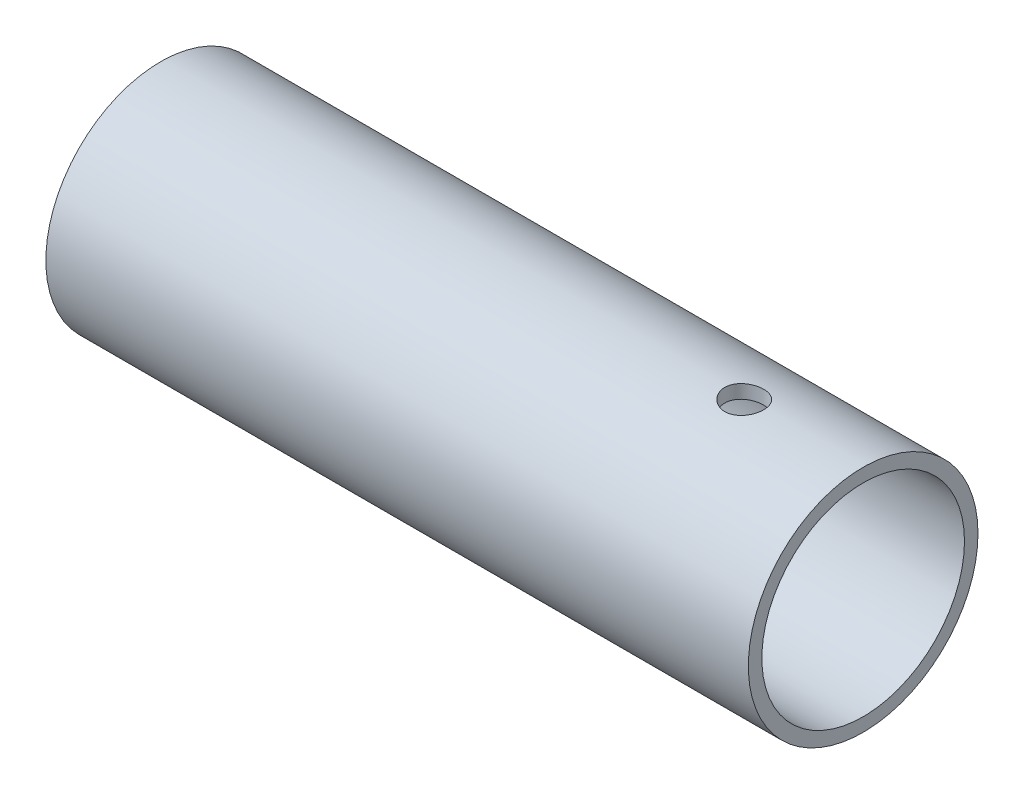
from build123d import *

# Parameters (mm, degrees)
SKETCH1_R           = 53.975
SKETCH1_R_2         = 47.625
BOSS_EXTRUDE1_DEPTH = 330.2
SKETCH2_R           = 9.128125
CUT_EXTRUDE1_DEPTH  = 98.552
SKETCH3_R           = 9.128125
CUT_EXTRUDE2_DEPTH  = 136.906


with BuildPart() as part:
    # Sketch1 → Boss-Extrude1 (new body)
    with BuildSketch(Plane(origin=(0, 0, 0), x_dir=(0, 0, -1), z_dir=(1, 0, 0))):
        Circle(SKETCH1_R)
        Circle(SKETCH1_R_2, mode=Mode.SUBTRACT)
    extrude(amount=BOSS_EXTRUDE1_DEPTH)

    # Sketch2 → Cut-Extrude1 (cut)
    with BuildSketch(Plane(origin=(0, 0, 0), x_dir=(1, 0, 0), z_dir=(0, 1, 0))):
        with Locations(Location((55.88, 0, 0), (0, 0, 270))):
            Circle(SKETCH2_R)
    extrude(amount=-CUT_EXTRUDE1_DEPTH, mode=Mode.SUBTRACT)

    # Sketch3 → Cut-Extrude2 (cut)
    with BuildSketch(Plane(origin=(0, 0, 0), x_dir=(1, 0, 0), z_dir=(0, 1, 0))):
        with Locations(Location((274.32, 0, 0), (0, 0, 90))):
            Circle(SKETCH3_R)
    extrude(amount=CUT_EXTRUDE2_DEPTH, mode=Mode.SUBTRACT)


solid = part.part
